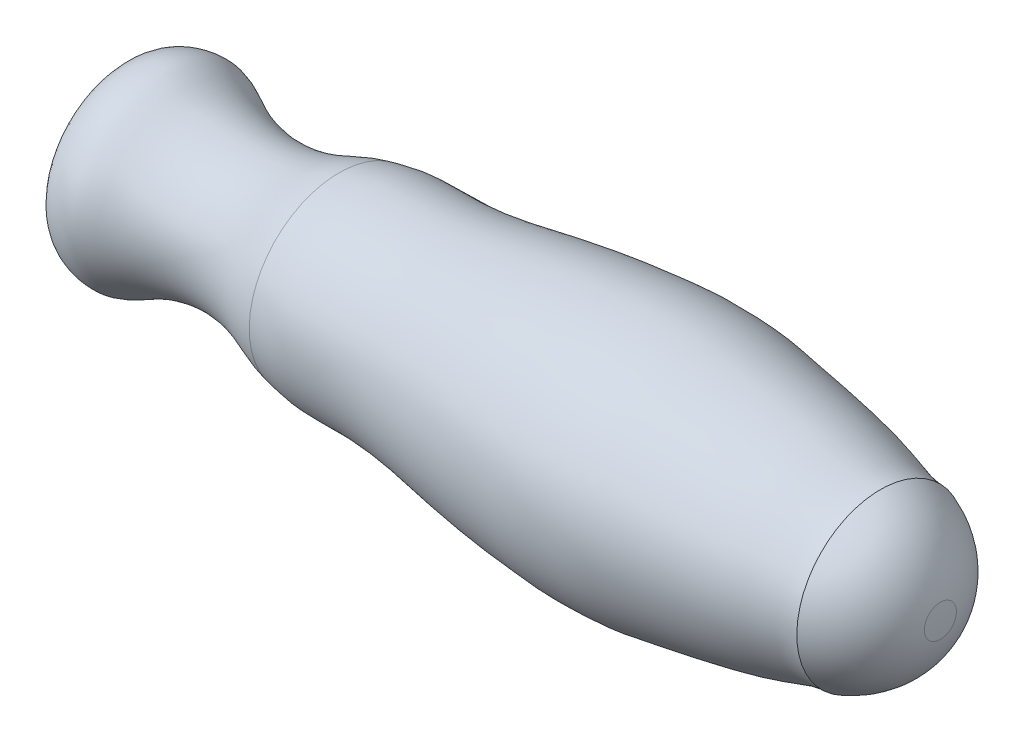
ISO-10303-21;
HEADER;
FILE_DESCRIPTION(('STEP AP214'),'2;1');
FILE_NAME('part.step','',(''),(''),'','','');
FILE_SCHEMA(('AUTOMOTIVE_DESIGN { 1 0 10303 214 1 1 1 1 }'));
ENDSEC;
DATA;
#1=APPLICATION_CONTEXT('core data for automotive mechanical design processes');
#2=APPLICATION_PROTOCOL_DEFINITION('international standard','automotive_design',2000,#1);
#3=PRODUCT_CONTEXT('',#1,'mechanical');
#4=PRODUCT('Part','Part','',(#3));
#5=PRODUCT_RELATED_PRODUCT_CATEGORY('part','',(#4));
#6=PRODUCT_DEFINITION_FORMATION('','',#4);
#7=PRODUCT_DEFINITION_CONTEXT('part definition',#1,'design');
#8=PRODUCT_DEFINITION('design','',#6,#7);
#9=PRODUCT_DEFINITION_SHAPE('','',#8);
#10=(LENGTH_UNIT() NAMED_UNIT(*) SI_UNIT(.MILLI.,.METRE.));
#11=(NAMED_UNIT(*) PLANE_ANGLE_UNIT() SI_UNIT($,.RADIAN.));
#12=(NAMED_UNIT(*) SI_UNIT($,.STERADIAN.) SOLID_ANGLE_UNIT());
#13=UNCERTAINTY_MEASURE_WITH_UNIT(LENGTH_MEASURE(1.E-05),#10,'distance_accuracy_value','');
#14=(GEOMETRIC_REPRESENTATION_CONTEXT(3) GLOBAL_UNCERTAINTY_ASSIGNED_CONTEXT((#13)) GLOBAL_UNIT_ASSIGNED_CONTEXT((#10,
#11,#12)) REPRESENTATION_CONTEXT('',''));
#15=CARTESIAN_POINT('',(0.,0.,0.));
#16=DIRECTION('',(0.,0.,1.));
#17=DIRECTION('',(1.,0.,0.));
#18=AXIS2_PLACEMENT_3D('',#15,#16,#17);
#19=CARTESIAN_POINT('',(0.,0.,0.));
#20=DIRECTION('',(-0.999988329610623,-0.00483121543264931,0.));
#21=DIRECTION('',(0.00483121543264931,-0.999988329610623,0.));
#22=AXIS2_PLACEMENT_3D('',#19,#20,#21);
#23=CONICAL_SURFACE('',#22,0.,1.5659650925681);
#24=CARTESIAN_POINT('',(-0.0164328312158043,-7.93914743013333E-05,0.));
#25=DIRECTION('',(-0.999988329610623,-0.00483121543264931,0.));
#26=DIRECTION('',(0.00483121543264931,-0.999988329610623,0.));
#27=AXIS2_PLACEMENT_3D('',#24,#25,#26);
#28=CIRCLE('',#27,3.40138655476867);
#29=CARTESIAN_POINT('',(0.,-3.40142625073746,0.));
#30=VERTEX_POINT('',#29);
#31=EDGE_CURVE('E11',#30,#30,#28,.T.);
#32=ORIENTED_EDGE('',*,*,#31,.T.);
#33=EDGE_LOOP('',(#32));
#34=FACE_BOUND('',#33,.T.);
#35=CARTESIAN_POINT('',(0.,0.,0.));
#36=VERTEX_POINT('',#35);
#37=VERTEX_LOOP('',#36);
#38=FACE_BOUND('',#37,.T.);
#39=ADVANCED_FACE('F33',(#34,#38),#23,.F.);
#40=CARTESIAN_POINT('',(0.,-3.40142625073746,0.));
#41=CARTESIAN_POINT('',(-0.15562647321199,-7.16439135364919,0.));
#42=CARTESIAN_POINT('',(0.545364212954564,-10.8774958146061,0.));
#43=B_SPLINE_CURVE_WITH_KNOTS('',2,(#40,#41,#42),.UNSPECIFIED.,.F.,.F.,(3,3),(0.,1.),.UNSPECIFIED.);
#44=CARTESIAN_POINT('',(0.,0.,0.));
#45=DIRECTION('',(-0.999988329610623,-0.00483121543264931,0.));
#46=AXIS1_PLACEMENT('',#44,#45);
#47=SURFACE_OF_REVOLUTION('',#43,#46);
#48=CARTESIAN_POINT('',(0.49280057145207,0.00238085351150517,0.));
#49=DIRECTION('',(-0.999988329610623,-0.00483121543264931,0.));
#50=DIRECTION('',(0.00483121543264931,-0.999988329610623,0.));
#51=AXIS2_PLACEMENT_3D('',#48,#49,#50);
#52=CIRCLE('',#51,10.8800036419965);
#53=CARTESIAN_POINT('',(0.545364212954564,-10.8774958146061,0.));
#54=VERTEX_POINT('',#53);
#55=EDGE_CURVE('E40',#54,#54,#52,.T.);
#56=ORIENTED_EDGE('',*,*,#55,.T.);
#57=EDGE_LOOP('',(#56));
#58=FACE_BOUND('',#57,.T.);
#59=ORIENTED_EDGE('',*,*,#31,.F.);
#60=EDGE_LOOP('',(#59));
#61=FACE_BOUND('',#60,.T.);
#62=ADVANCED_FACE('F47',(#58,#61),#47,.F.);
#63=CARTESIAN_POINT('',(0.545364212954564,-10.8774958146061,0.));
#64=CARTESIAN_POINT('',(1.37034871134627,-11.9743869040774,0.));
#65=CARTESIAN_POINT('',(3.32259956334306,-12.8302408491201,0.));
#66=CARTESIAN_POINT('',(6.19462989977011,-12.9244191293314,0.));
#67=CARTESIAN_POINT('',(8.21729207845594,-11.8858709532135,0.));
#68=CARTESIAN_POINT('',(10.5136735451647,-10.6744661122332,0.));
#69=CARTESIAN_POINT('',(13.281514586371,-9.80869703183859,0.));
#70=CARTESIAN_POINT('',(16.6319516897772,-9.22347666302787,0.));
#71=CARTESIAN_POINT('',(20.2629187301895,-9.32596056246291,0.));
#72=CARTESIAN_POINT('',(24.1568373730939,-10.1633752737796,0.));
#73=CARTESIAN_POINT('',(27.1905964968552,-11.558728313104,0.));
#74=CARTESIAN_POINT('',(29.1632772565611,-12.0599366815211,0.));
#75=CARTESIAN_POINT('',(29.7779090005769,-12.2061348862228,0.));
#76=B_SPLINE_CURVE_WITH_KNOTS('',3,(#63,#64,#65,#66,#67,#68,#69,#70,#71,#72,#73,#74,#75),
.UNSPECIFIED.,.F.,.F.,(4,1,1,1,1,1,1,1,1,1,4),(0.,0.120356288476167,0.182103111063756,
0.252493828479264,0.320379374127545,0.416926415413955,0.511670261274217,0.625759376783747,
0.741661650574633,0.867963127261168,0.924773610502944),.UNSPECIFIED.);
#77=CARTESIAN_POINT('',(0.,0.,0.));
#78=DIRECTION('',(-0.999988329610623,-0.00483121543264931,0.));
#79=AXIS1_PLACEMENT('',#77,#78);
#80=SURFACE_OF_REVOLUTION('',#76,#79);
#81=CARTESIAN_POINT('',(29.7182441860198,0.143576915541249,0.));
#82=DIRECTION('',(-0.999988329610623,-0.00483121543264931,0.));
#83=DIRECTION('',(0.00483121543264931,-0.999988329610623,0.));
#84=AXIS2_PLACEMENT_3D('',#81,#82,#83);
#85=CIRCLE('',#84,12.3498559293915);
#86=CARTESIAN_POINT('',(29.7779090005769,-12.2061348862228,0.));
#87=VERTEX_POINT('',#86);
#88=EDGE_CURVE('E112',#87,#87,#85,.T.);
#89=ORIENTED_EDGE('',*,*,#88,.T.);
#90=EDGE_LOOP('',(#89));
#91=FACE_BOUND('',#90,.T.);
#92=ORIENTED_EDGE('',*,*,#55,.F.);
#93=EDGE_LOOP('',(#92));
#94=FACE_BOUND('',#93,.T.);
#95=ADVANCED_FACE('F52',(#91,#94),#80,.F.);
#96=CARTESIAN_POINT('',(29.7779090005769,-12.2061348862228,0.));
#97=CARTESIAN_POINT('',(31.1346179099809,-12.4503532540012,0.));
#98=CARTESIAN_POINT('',(33.1675652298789,-12.8911490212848,0.));
#99=CARTESIAN_POINT('',(36.3876480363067,-12.9050924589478,0.));
#100=CARTESIAN_POINT('',(39.1715363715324,-12.8798778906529,0.));
#101=CARTESIAN_POINT('',(42.6259033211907,-12.9791040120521,0.));
#102=CARTESIAN_POINT('',(46.2180468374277,-13.3469629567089,0.));
#103=CARTESIAN_POINT('',(49.9167304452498,-14.0067787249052,0.));
#104=CARTESIAN_POINT('',(53.6218083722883,-14.6404916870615,0.));
#105=CARTESIAN_POINT('',(57.2661896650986,-15.1744291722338,0.));
#106=CARTESIAN_POINT('',(61.1201600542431,-15.6812353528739,0.));
#107=CARTESIAN_POINT('',(65.1405088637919,-15.9976015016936,0.));
#108=CARTESIAN_POINT('',(69.2720383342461,-16.4213874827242,0.));
#109=CARTESIAN_POINT('',(73.6065603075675,-16.3521229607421,0.));
#110=CARTESIAN_POINT('',(77.7838995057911,-16.2161925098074,0.));
#111=CARTESIAN_POINT('',(81.9902090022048,-15.5315842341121,0.));
#112=CARTESIAN_POINT('',(86.3140591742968,-14.8039570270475,0.));
#113=CARTESIAN_POINT('',(91.8474270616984,-13.8515046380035,0.));
#114=CARTESIAN_POINT('',(97.7508899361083,-12.5390196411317,0.));
#115=CARTESIAN_POINT('',(101.929439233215,-10.9603572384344,0.));
#116=CARTESIAN_POINT('',(103.818425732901,-10.9881922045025,0.));
#117=B_SPLINE_CURVE_WITH_KNOTS('',3,(#96,#97,#98,#99,#100,#101,#102,#103,#104,#105,#106,#107,
#108,#109,#110,#111,#112,#113,#114,#115,#116),.UNSPECIFIED.,.F.,.F.,(4,1,1,1,1,1,1,1,1,1,1,1,1,
1,1,1,1,1,4),(0.,0.0553981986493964,0.0826774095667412,0.128818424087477,0.167035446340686,
0.221096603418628,0.273333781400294,0.317568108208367,0.371733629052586,0.420941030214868,
0.473294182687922,0.533363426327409,0.587167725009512,0.646878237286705,0.700631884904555,
0.757710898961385,0.822668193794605,0.92558882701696,1.),.UNSPECIFIED.);
#118=CARTESIAN_POINT('',(0.,0.,0.));
#119=DIRECTION('',(-0.999988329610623,-0.00483121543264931,0.));
#120=AXIS1_PLACEMENT('',#118,#119);
#121=SURFACE_OF_REVOLUTION('',#117,#120);
#122=CARTESIAN_POINT('',(103.762916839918,0.501306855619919,0.));
#123=DIRECTION('',(-0.999988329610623,-0.00483121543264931,0.));
#124=DIRECTION('',(0.00483121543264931,-0.999988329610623,0.));
#125=AXIS2_PLACEMENT_3D('',#122,#123,#124);
#126=CIRCLE('',#125,11.489633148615);
#127=CARTESIAN_POINT('',(103.818425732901,-10.9881922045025,0.));
#128=VERTEX_POINT('',#127);
#129=EDGE_CURVE('E109',#128,#128,#126,.T.);
#130=ORIENTED_EDGE('',*,*,#129,.T.);
#131=EDGE_LOOP('',(#130));
#132=FACE_BOUND('',#131,.T.);
#133=ORIENTED_EDGE('',*,*,#88,.F.);
#134=EDGE_LOOP('',(#133));
#135=FACE_BOUND('',#134,.T.);
#136=ADVANCED_FACE('F59',(#132,#135),#121,.F.);
#137=CARTESIAN_POINT('',(103.818425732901,-10.9881922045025,0.));
#138=CARTESIAN_POINT('',(105.386632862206,-10.3955734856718,0.));
#139=CARTESIAN_POINT('',(109.210159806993,-8.22697266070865,0.));
#140=CARTESIAN_POINT('',(111.462986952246,-4.23080075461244,0.));
#141=CARTESIAN_POINT('',(111.922279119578,-1.65220556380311,0.));
#142=B_SPLINE_CURVE_WITH_KNOTS('',3,(#137,#138,#139,#140,#141),.UNSPECIFIED.,.F.,.F.,(4,1,4),
(0.,0.39082533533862,1.),.UNSPECIFIED.);
#143=CARTESIAN_POINT('',(0.,0.,0.));
#144=DIRECTION('',(-0.999988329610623,-0.00483121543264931,0.));
#145=AXIS1_PLACEMENT('',#143,#144);
#146=SURFACE_OF_REVOLUTION('',#142,#145);
#147=CARTESIAN_POINT('',(111.911684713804,0.540675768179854,0.));
#148=DIRECTION('',(-0.999988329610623,-0.00483121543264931,0.));
#149=DIRECTION('',(0.00483121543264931,-0.999988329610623,0.));
#150=AXIS2_PLACEMENT_3D('',#147,#148,#149);
#151=CIRCLE('',#150,2.19290692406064);
#152=CARTESIAN_POINT('',(111.922279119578,-1.65220556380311,0.));
#153=VERTEX_POINT('',#152);
#154=EDGE_CURVE('E103',#153,#153,#151,.T.);
#155=ORIENTED_EDGE('',*,*,#154,.T.);
#156=EDGE_LOOP('',(#155));
#157=FACE_BOUND('',#156,.T.);
#158=ORIENTED_EDGE('',*,*,#129,.F.);
#159=EDGE_LOOP('',(#158));
#160=FACE_BOUND('',#159,.T.);
#161=ADVANCED_FACE('F92',(#157,#160),#146,.F.);
#162=CARTESIAN_POINT('',(111.922279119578,-1.65220556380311,0.));
#163=CARTESIAN_POINT('',(112.005297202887,-0.555338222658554,0.));
#164=CARTESIAN_POINT('',(112.,0.541102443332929,0.));
#165=B_SPLINE_CURVE_WITH_KNOTS('',2,(#162,#163,#164),.UNSPECIFIED.,.F.,.F.,(3,3),(0.5,1.),.UNSPECIFIED.);
#166=CARTESIAN_POINT('',(0.,0.,0.));
#167=DIRECTION('',(-0.999988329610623,-0.00483121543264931,0.));
#168=AXIS1_PLACEMENT('',#166,#167);
#169=SURFACE_OF_REVOLUTION('',#165,#168);
#170=CARTESIAN_POINT('',(112.,0.541102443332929,0.));
#171=VERTEX_POINT('',#170);
#172=VERTEX_LOOP('',#171);
#173=FACE_BOUND('',#172,.T.);
#174=ORIENTED_EDGE('',*,*,#154,.F.);
#175=EDGE_LOOP('',(#174));
#176=FACE_BOUND('',#175,.T.);
#177=ADVANCED_FACE('F96',(#173,#176),#169,.F.);
#178=CLOSED_SHELL('',(#39,#62,#95,#136,#161,#177));
#179=MANIFOLD_SOLID_BREP('B2',#178);
#180=ADVANCED_BREP_SHAPE_REPRESENTATION('',(#18,#179),#14);
#181=SHAPE_DEFINITION_REPRESENTATION(#9,#180);
ENDSEC;
END-ISO-10303-21;
